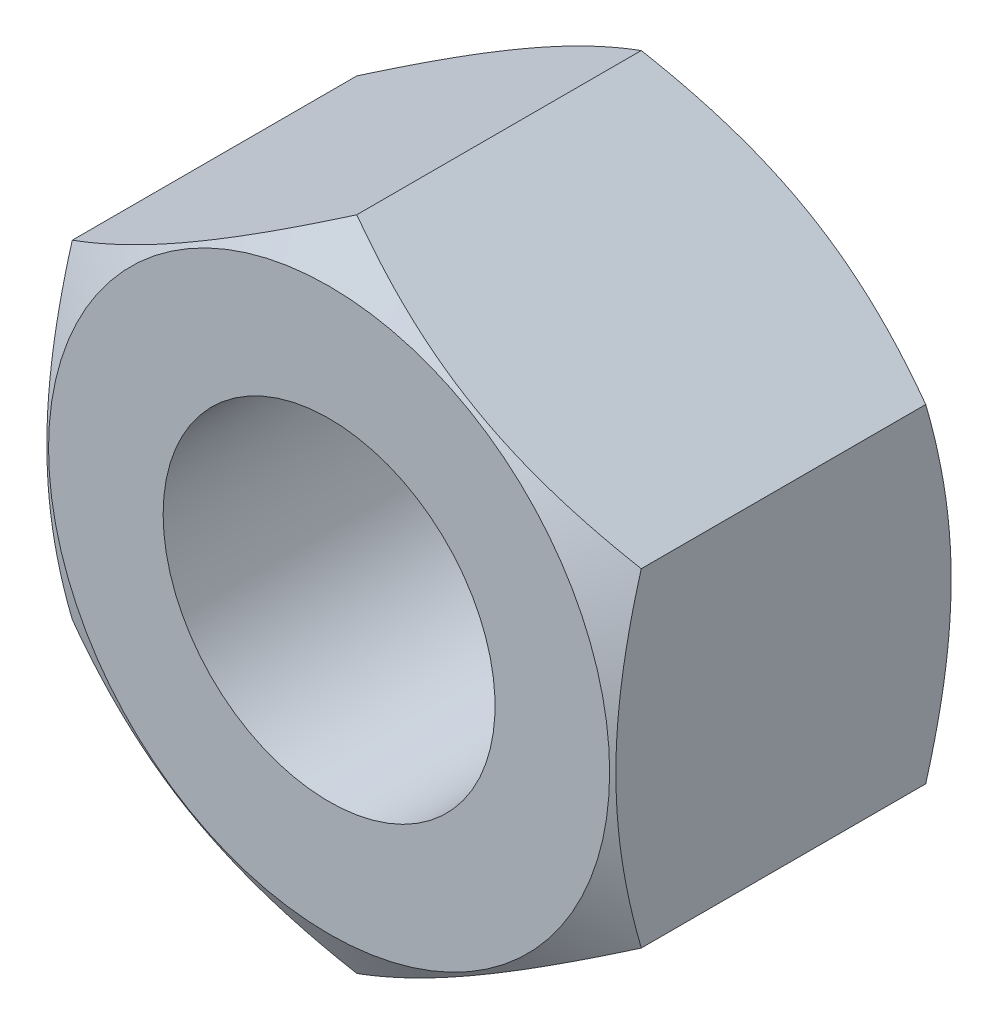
ISO-10303-21;
HEADER;
FILE_DESCRIPTION(('STEP AP214'),'2;1');
FILE_NAME('part.step','',(''),(''),'','','');
FILE_SCHEMA(('AUTOMOTIVE_DESIGN { 1 0 10303 214 1 1 1 1 }'));
ENDSEC;
DATA;
#1=APPLICATION_CONTEXT('core data for automotive mechanical design processes');
#2=APPLICATION_PROTOCOL_DEFINITION('international standard','automotive_design',2000,#1);
#3=PRODUCT_CONTEXT('',#1,'mechanical');
#4=PRODUCT('Part','Part','',(#3));
#5=PRODUCT_RELATED_PRODUCT_CATEGORY('part','',(#4));
#6=PRODUCT_DEFINITION_FORMATION('','',#4);
#7=PRODUCT_DEFINITION_CONTEXT('part definition',#1,'design');
#8=PRODUCT_DEFINITION('design','',#6,#7);
#9=PRODUCT_DEFINITION_SHAPE('','',#8);
#10=(LENGTH_UNIT() NAMED_UNIT(*) SI_UNIT(.MILLI.,.METRE.));
#11=(NAMED_UNIT(*) PLANE_ANGLE_UNIT() SI_UNIT($,.RADIAN.));
#12=(NAMED_UNIT(*) SI_UNIT($,.STERADIAN.) SOLID_ANGLE_UNIT());
#13=UNCERTAINTY_MEASURE_WITH_UNIT(LENGTH_MEASURE(1.E-05),#10,'distance_accuracy_value','');
#14=(GEOMETRIC_REPRESENTATION_CONTEXT(3) GLOBAL_UNCERTAINTY_ASSIGNED_CONTEXT((#13)) GLOBAL_UNIT_ASSIGNED_CONTEXT((#10,
#11,#12)) REPRESENTATION_CONTEXT('',''));
#15=CARTESIAN_POINT('',(0.,0.,0.));
#16=DIRECTION('',(0.,0.,1.));
#17=DIRECTION('',(1.,0.,0.));
#18=AXIS2_PLACEMENT_3D('',#15,#16,#17);
#19=CARTESIAN_POINT('',(18.,-10.3923048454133,21.5));
#20=DIRECTION('',(-1.,0.,0.));
#21=DIRECTION('',(0.,-1.,0.));
#22=AXIS2_PLACEMENT_3D('',#19,#20,#21);
#23=PLANE('',#22);
#24=DIRECTION('',(0.,0.,-1.));
#25=VECTOR('',#24,1.);
#26=CARTESIAN_POINT('',(18.,10.3923048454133,21.5));
#27=LINE('',#26,#25);
#28=CARTESIAN_POINT('',(18.,10.3923048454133,19.7479672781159));
#29=VERTEX_POINT('',#28);
#30=CARTESIAN_POINT('',(18.,10.3923048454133,1.75203272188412));
#31=VERTEX_POINT('',#30);
#32=EDGE_CURVE('E11',#29,#31,#27,.T.);
#33=ORIENTED_EDGE('',*,*,#32,.F.);
#34=CARTESIAN_POINT('',(18.,-27.5419091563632,12.7518557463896));
#35=CARTESIAN_POINT('',(18.,-27.1468507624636,12.9427796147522));
#36=CARTESIAN_POINT('',(18.,-26.7513142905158,13.1327137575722));
#37=CARTESIAN_POINT('',(18.,-25.9591841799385,13.5103753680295));
#38=CARTESIAN_POINT('',(18.,-25.5625905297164,13.6981028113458));
#39=CARTESIAN_POINT('',(18.,-24.3709558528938,14.2576887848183));
#40=CARTESIAN_POINT('',(18.,-23.5741898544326,14.6258885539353));
#41=CARTESIAN_POINT('',(18.,-21.9705755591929,15.3522614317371));
#42=CARTESIAN_POINT('',(18.,-21.1636956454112,15.710364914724));
#43=CARTESIAN_POINT('',(18.,-19.5432973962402,16.4111677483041));
#44=CARTESIAN_POINT('',(18.,-18.7297794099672,16.7538679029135));
#45=CARTESIAN_POINT('',(18.,-17.0848055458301,17.4237877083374));
#46=CARTESIAN_POINT('',(18.,-16.2532518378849,17.7507683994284));
#47=CARTESIAN_POINT('',(18.,-14.5803233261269,18.3790718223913));
#48=CARTESIAN_POINT('',(18.,-13.7389474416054,18.6803917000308));
#49=CARTESIAN_POINT('',(18.,-12.0467985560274,19.249258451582));
#50=CARTESIAN_POINT('',(18.,-11.1960499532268,19.5168773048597));
#51=CARTESIAN_POINT('',(18.,-9.48237686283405,20.0096508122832));
#52=CARTESIAN_POINT('',(18.,-8.61945632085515,20.234818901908));
#53=CARTESIAN_POINT('',(18.,-7.31578110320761,20.5324814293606));
#54=CARTESIAN_POINT('',(18.,-6.87957664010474,20.6250366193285));
#55=CARTESIAN_POINT('',(18.,-6.00426857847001,20.7953196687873));
#56=CARTESIAN_POINT('',(18.,-5.56516504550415,20.8730478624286));
#57=CARTESIAN_POINT('',(18.,-4.68435502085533,21.0122977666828));
#58=CARTESIAN_POINT('',(18.,-4.24264837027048,21.0738184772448));
#59=CARTESIAN_POINT('',(18.,-3.35713985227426,21.179417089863));
#60=CARTESIAN_POINT('',(18.,-2.91333798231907,21.2234949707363));
#61=CARTESIAN_POINT('',(18.,-2.02709190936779,21.2930223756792));
#62=CARTESIAN_POINT('',(18.,-1.58465687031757,21.3185879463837));
#63=CARTESIAN_POINT('',(18.,-0.699103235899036,21.3509566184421));
#64=CARTESIAN_POINT('',(18.,-0.255984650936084,21.3577600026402));
#65=CARTESIAN_POINT('',(18.,0.630018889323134,21.3524430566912));
#66=CARTESIAN_POINT('',(18.,1.07290387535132,21.3403279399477));
#67=CARTESIAN_POINT('',(18.,1.95777383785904,21.29747464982));
#68=CARTESIAN_POINT('',(18.,2.39975877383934,21.2667356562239));
#69=CARTESIAN_POINT('',(18.,3.47131410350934,21.1702750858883));
#70=CARTESIAN_POINT('',(18.,4.10005931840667,21.0952051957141));
#71=CARTESIAN_POINT('',(18.,5.35261077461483,20.9115617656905));
#72=CARTESIAN_POINT('',(18.,5.97641626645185,20.8029832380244));
#73=CARTESIAN_POINT('',(18.,7.84151804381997,20.4324322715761));
#74=CARTESIAN_POINT('',(18.,9.07406142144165,20.1258918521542));
#75=CARTESIAN_POINT('',(18.,10.9177013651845,19.5974851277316));
#76=CARTESIAN_POINT('',(18.,11.5384347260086,19.407337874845));
#77=CARTESIAN_POINT('',(18.,12.7739044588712,19.0081272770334));
#78=CARTESIAN_POINT('',(18.,13.3886402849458,18.7990622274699));
#79=CARTESIAN_POINT('',(18.,14.609050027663,18.3664674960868));
#80=CARTESIAN_POINT('',(18.,15.2147555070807,18.1430261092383));
#81=CARTESIAN_POINT('',(18.,16.1195013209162,17.7982107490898));
#82=CARTESIAN_POINT('',(18.,16.4203993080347,17.6816831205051));
#83=CARTESIAN_POINT('',(18.,17.021027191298,17.445671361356));
#84=CARTESIAN_POINT('',(18.,17.3207571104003,17.326187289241));
#85=CARTESIAN_POINT('',(18.,17.6199435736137,17.2053584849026));
#86=B_SPLINE_CURVE_WITH_KNOTS('',3,(#34,#35,#36,#37,#38,#39,#40,#41,#42,#43,#44,#45,#46,#47,#48,
#49,#50,#51,#52,#53,#54,#55,#56,#57,#58,#59,#60,#61,#62,#63,#64,#65,#66,#67,#68,#69,#70,#71,#72,
#73,#74,#75,#76,#77,#78,#79,#80,#81,#82,#83,#84,#85),.UNSPECIFIED.,.F.,.F.,(4,2,2,2,2,2,2,2,2,2,
2,2,2,2,2,2,2,2,2,2,2,2,2,2,2,4),(0.,1.31632091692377,2.63265632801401,5.26575636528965,
7.91395956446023,10.5620243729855,13.2422944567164,15.9228622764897,18.5976041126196,
21.2714979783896,22.6090335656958,23.9465390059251,25.2841269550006,26.6217165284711,
27.9508469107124,29.2799572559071,30.6087014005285,31.9375040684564,33.8360577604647,
35.7348941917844,39.5398865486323,41.4873464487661,43.4349820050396,45.3716254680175,
46.3396328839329,47.3076211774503),.UNSPECIFIED.);
#87=CARTESIAN_POINT('',(18.,-10.3923048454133,19.7479672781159));
#88=VERTEX_POINT('',#87);
#89=EDGE_CURVE('E183',#29,#88,#86,.F.);
#90=ORIENTED_EDGE('',*,*,#89,.T.);
#91=DIRECTION('',(0.,0.,-1.));
#92=VECTOR('',#91,1.);
#93=CARTESIAN_POINT('',(18.,-10.3923048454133,21.5));
#94=LINE('',#93,#92);
#95=CARTESIAN_POINT('',(18.,-10.3923048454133,1.75203272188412));
#96=VERTEX_POINT('',#95);
#97=EDGE_CURVE('E58',#88,#96,#94,.T.);
#98=ORIENTED_EDGE('',*,*,#97,.T.);
#99=CARTESIAN_POINT('',(18.,-27.5419091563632,8.74814425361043));
#100=CARTESIAN_POINT('',(18.,-27.1468507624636,8.5572203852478));
#101=CARTESIAN_POINT('',(18.,-26.7513142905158,8.36728624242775));
#102=CARTESIAN_POINT('',(18.,-25.9591841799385,7.98962463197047));
#103=CARTESIAN_POINT('',(18.,-25.5625905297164,7.80189718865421));
#104=CARTESIAN_POINT('',(18.,-24.3709558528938,7.24231121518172));
#105=CARTESIAN_POINT('',(18.,-23.5741898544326,6.87411144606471));
#106=CARTESIAN_POINT('',(18.,-21.9705755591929,6.14773856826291));
#107=CARTESIAN_POINT('',(18.,-21.1636956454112,5.78963508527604));
#108=CARTESIAN_POINT('',(18.,-19.5432973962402,5.08883225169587));
#109=CARTESIAN_POINT('',(18.,-18.7297794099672,4.74613209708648));
#110=CARTESIAN_POINT('',(18.,-17.0848055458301,4.07621229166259));
#111=CARTESIAN_POINT('',(18.,-16.2532518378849,3.74923160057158));
#112=CARTESIAN_POINT('',(18.,-14.5803233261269,3.1209281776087));
#113=CARTESIAN_POINT('',(18.,-13.7389474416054,2.81960829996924));
#114=CARTESIAN_POINT('',(18.,-12.0467985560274,2.25074154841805));
#115=CARTESIAN_POINT('',(18.,-11.1960499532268,1.98312269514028));
#116=CARTESIAN_POINT('',(18.,-9.48237686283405,1.49034918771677));
#117=CARTESIAN_POINT('',(18.,-8.61945632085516,1.26518109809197));
#118=CARTESIAN_POINT('',(18.,-7.31578110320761,0.967518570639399));
#119=CARTESIAN_POINT('',(18.,-6.87957664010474,0.874963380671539));
#120=CARTESIAN_POINT('',(18.,-6.00426857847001,0.704680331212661));
#121=CARTESIAN_POINT('',(18.,-5.56516504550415,0.626952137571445));
#122=CARTESIAN_POINT('',(18.,-4.68435502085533,0.487702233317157));
#123=CARTESIAN_POINT('',(18.,-4.24264837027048,0.426181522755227));
#124=CARTESIAN_POINT('',(18.,-3.35713985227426,0.320582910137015));
#125=CARTESIAN_POINT('',(18.,-2.91333798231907,0.276505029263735));
#126=CARTESIAN_POINT('',(18.,-2.02709190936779,0.206977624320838));
#127=CARTESIAN_POINT('',(18.,-1.58465687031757,0.181412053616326));
#128=CARTESIAN_POINT('',(18.,-0.699103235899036,0.149043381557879));
#129=CARTESIAN_POINT('',(18.,-0.255984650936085,0.142239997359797));
#130=CARTESIAN_POINT('',(18.,0.630018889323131,0.147556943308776));
#131=CARTESIAN_POINT('',(18.,1.07290387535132,0.159672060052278));
#132=CARTESIAN_POINT('',(18.,1.95777383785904,0.202525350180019));
#133=CARTESIAN_POINT('',(18.,2.39975877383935,0.233264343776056));
#134=CARTESIAN_POINT('',(18.,3.47131410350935,0.329724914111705));
#135=CARTESIAN_POINT('',(18.,4.10005931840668,0.404794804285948));
#136=CARTESIAN_POINT('',(18.,5.35261077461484,0.588438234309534));
#137=CARTESIAN_POINT('',(18.,5.97641626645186,0.697016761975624));
#138=CARTESIAN_POINT('',(18.,7.84151804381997,1.06756772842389));
#139=CARTESIAN_POINT('',(18.,9.07406142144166,1.37410814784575));
#140=CARTESIAN_POINT('',(18.,10.9177013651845,1.90251487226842));
#141=CARTESIAN_POINT('',(18.,11.5384347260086,2.09266212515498));
#142=CARTESIAN_POINT('',(18.,12.7739044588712,2.49187272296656));
#143=CARTESIAN_POINT('',(18.,13.3886402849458,2.70093777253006));
#144=CARTESIAN_POINT('',(18.,14.609050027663,3.13353250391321));
#145=CARTESIAN_POINT('',(18.,15.2147555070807,3.3569738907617));
#146=CARTESIAN_POINT('',(18.,16.1195013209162,3.7017892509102));
#147=CARTESIAN_POINT('',(18.,16.4203993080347,3.81831687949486));
#148=CARTESIAN_POINT('',(18.,17.021027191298,4.05432863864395));
#149=CARTESIAN_POINT('',(18.,17.3207571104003,4.17381271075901));
#150=CARTESIAN_POINT('',(18.,17.6199435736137,4.29464151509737));
#151=B_SPLINE_CURVE_WITH_KNOTS('',3,(#99,#100,#101,#102,#103,#104,#105,#106,#107,#108,#109,#110,
#111,#112,#113,#114,#115,#116,#117,#118,#119,#120,#121,#122,#123,#124,#125,#126,#127,#128,#129,
#130,#131,#132,#133,#134,#135,#136,#137,#138,#139,#140,#141,#142,#143,#144,#145,#146,#147,#148,
#149,#150),.UNSPECIFIED.,.F.,.F.,(4,2,2,2,2,2,2,2,2,2,2,2,2,2,2,2,2,2,2,2,2,2,2,2,2,4),(0.,
1.31632091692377,2.63265632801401,5.26575636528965,7.91395956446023,10.5620243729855,
13.2422944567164,15.9228622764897,18.5976041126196,21.2714979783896,22.6090335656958,
23.9465390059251,25.2841269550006,26.6217165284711,27.9508469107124,29.2799572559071,
30.6087014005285,31.9375040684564,33.8360577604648,35.7348941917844,39.5398865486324,
41.4873464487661,43.4349820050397,45.3716254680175,46.3396328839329,47.3076211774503),.UNSPECIFIED.);
#152=EDGE_CURVE('E115',#96,#31,#151,.T.);
#153=ORIENTED_EDGE('',*,*,#152,.T.);
#154=EDGE_LOOP('',(#33,#90,#98,#153));
#155=FACE_BOUND('',#154,.T.);
#156=ADVANCED_FACE('F35',(#155),#23,.F.);
#157=CARTESIAN_POINT('',(18.,10.3923048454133,21.5));
#158=DIRECTION('',(-0.5,-0.866025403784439,0.));
#159=DIRECTION('',(0.866025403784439,-0.5,0.));
#160=AXIS2_PLACEMENT_3D('',#157,#158,#159);
#161=PLANE('',#160);
#162=DIRECTION('',(0.,0.,-1.));
#163=VECTOR('',#162,1.);
#164=CARTESIAN_POINT('',(0.,20.7846096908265,21.5));
#165=LINE('',#164,#163);
#166=CARTESIAN_POINT('',(0.,20.7846096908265,19.7479672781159));
#167=VERTEX_POINT('',#166);
#168=CARTESIAN_POINT('',(0.,20.7846096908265,1.75203272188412));
#169=VERTEX_POINT('',#168);
#170=EDGE_CURVE('E43',#167,#169,#165,.T.);
#171=ORIENTED_EDGE('',*,*,#170,.F.);
#172=CARTESIAN_POINT('',(-0.000199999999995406,20.7847251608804,19.7479006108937));
#173=CARTESIAN_POINT('',(0.395432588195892,20.5563065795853,19.8797690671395));
#174=CARTESIAN_POINT('',(0.792608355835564,20.3269970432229,20.0056535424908));
#175=CARTESIAN_POINT('',(1.59014476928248,19.8665391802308,20.2437911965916));
#176=CARTESIAN_POINT('',(1.99050641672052,19.6353902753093,20.3560398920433));
#177=CARTESIAN_POINT('',(2.79518836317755,19.1708069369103,20.5653971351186));
#178=CARTESIAN_POINT('',(3.19951570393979,18.9373684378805,20.6624698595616));
#179=CARTESIAN_POINT('',(4.01097986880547,18.4688693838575,20.8393906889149));
#180=CARTESIAN_POINT('',(4.41811653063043,18.2338089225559,20.9192397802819));
#181=CARTESIAN_POINT('',(5.22476711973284,17.7680889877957,21.0583171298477));
#182=CARTESIAN_POINT('',(5.62422116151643,17.537464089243,21.118005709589));
#183=CARTESIAN_POINT('',(6.42495960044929,17.0751575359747,21.2180900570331));
#184=CARTESIAN_POINT('',(6.82624403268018,16.8434758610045,21.2584854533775));
#185=CARTESIAN_POINT('',(7.62948698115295,16.3797233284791,21.318963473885));
#186=CARTESIAN_POINT('',(8.03144412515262,16.1476532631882,21.3390702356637));
#187=CARTESIAN_POINT('',(8.83572943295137,15.6832989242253,21.3585385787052));
#188=CARTESIAN_POINT('',(9.23805758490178,15.4510146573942,21.3579008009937));
#189=CARTESIAN_POINT('',(9.99021934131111,15.0167538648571,21.3373288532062));
#190=CARTESIAN_POINT('',(10.3401065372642,14.8147463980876,21.3199032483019));
#191=CARTESIAN_POINT('',(11.0390463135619,14.4112133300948,21.2696933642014));
#192=CARTESIAN_POINT('',(11.3880989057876,14.209687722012,21.2369093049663));
#193=CARTESIAN_POINT('',(12.0852372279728,13.8071947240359,21.1565513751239));
#194=CARTESIAN_POINT('',(12.4333217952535,13.6062280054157,21.1089641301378));
#195=CARTESIAN_POINT('',(13.1278338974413,13.2052512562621,20.9998395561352));
#196=CARTESIAN_POINT('',(13.4742614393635,13.0052412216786,20.93830228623));
#197=CARTESIAN_POINT('',(14.525886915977,12.3980849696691,20.731200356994));
#198=CARTESIAN_POINT('',(15.228039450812,11.99269701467,20.5649849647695));
#199=CARTESIAN_POINT('',(16.6218747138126,11.1879658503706,20.1877442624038));
#200=CARTESIAN_POINT('',(17.3135752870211,10.78861233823,19.9768075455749));
#201=CARTESIAN_POINT('',(18.0002,10.3921893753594,19.7479006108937));
#202=B_SPLINE_CURVE_WITH_KNOTS('',3,(#172,#173,#174,#175,#176,#177,#178,#179,#180,#181,#182,
#183,#184,#185,#186,#187,#188,#189,#190,#191,#192,#193,#194,#195,#196,#197,#198,#199,#200,#201),
.UNSPECIFIED.,.F.,.F.,(4,2,2,2,2,2,2,2,2,2,2,2,2,2,4),(0.,1.42650335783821,2.85347447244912,
4.28376471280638,5.71397301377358,7.10888071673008,8.5038152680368,9.89708828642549,
11.2903182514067,12.5031974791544,13.7160593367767,14.9300201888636,16.1439758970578,
18.6253607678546,21.1018751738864),.UNSPECIFIED.);
#203=EDGE_CURVE('E92',#167,#29,#202,.T.);
#204=ORIENTED_EDGE('',*,*,#203,.T.);
#205=ORIENTED_EDGE('',*,*,#32,.T.);
#206=CARTESIAN_POINT('',(18.0002,10.3921893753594,1.75209938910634));
#207=CARTESIAN_POINT('',(17.6045674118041,10.6206079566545,1.62023093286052));
#208=CARTESIAN_POINT('',(17.2073916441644,10.8499174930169,1.49434645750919));
#209=CARTESIAN_POINT('',(16.4098552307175,11.310375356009,1.25620880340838));
#210=CARTESIAN_POINT('',(16.0094935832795,11.5415242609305,1.14396010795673));
#211=CARTESIAN_POINT('',(15.2048116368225,12.0061075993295,0.934602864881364));
#212=CARTESIAN_POINT('',(14.8004842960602,12.2395460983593,0.837530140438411));
#213=CARTESIAN_POINT('',(13.9890201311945,12.7080451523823,0.660609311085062));
#214=CARTESIAN_POINT('',(13.5818834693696,12.9431056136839,0.580760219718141));
#215=CARTESIAN_POINT('',(12.7752328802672,13.4088255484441,0.44168287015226));
#216=CARTESIAN_POINT('',(12.3757788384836,13.6394504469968,0.381994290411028));
#217=CARTESIAN_POINT('',(11.5750403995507,14.1017570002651,0.28190994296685));
#218=CARTESIAN_POINT('',(11.1737559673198,14.3334386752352,0.241514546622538));
#219=CARTESIAN_POINT('',(10.370513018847,14.7971912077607,0.181036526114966));
#220=CARTESIAN_POINT('',(9.96855587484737,15.0292612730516,0.160929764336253));
#221=CARTESIAN_POINT('',(9.16427056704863,15.4936156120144,0.141461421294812));
#222=CARTESIAN_POINT('',(8.76194241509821,15.7258998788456,0.142099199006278));
#223=CARTESIAN_POINT('',(8.00978065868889,16.1601606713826,0.162671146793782));
#224=CARTESIAN_POINT('',(7.65989346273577,16.3621681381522,0.18009675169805));
#225=CARTESIAN_POINT('',(6.96095368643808,16.765701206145,0.23030663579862));
#226=CARTESIAN_POINT('',(6.61190109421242,16.9672268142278,0.263090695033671));
#227=CARTESIAN_POINT('',(5.91476277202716,17.3697198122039,0.343448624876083));
#228=CARTESIAN_POINT('',(5.56667820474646,17.5706865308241,0.391035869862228));
#229=CARTESIAN_POINT('',(4.87216610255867,17.9716632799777,0.500160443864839));
#230=CARTESIAN_POINT('',(4.52573856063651,18.1716733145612,0.561697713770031));
#231=CARTESIAN_POINT('',(3.47411308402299,18.7788295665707,0.768799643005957));
#232=CARTESIAN_POINT('',(2.77196054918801,19.1842175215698,0.935015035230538));
#233=CARTESIAN_POINT('',(1.37812528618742,19.9889486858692,1.31225573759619));
#234=CARTESIAN_POINT('',(0.686424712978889,20.3883021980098,1.52319245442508));
#235=CARTESIAN_POINT('',(-0.000199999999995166,20.7847251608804,1.75209938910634));
#236=B_SPLINE_CURVE_WITH_KNOTS('',3,(#206,#207,#208,#209,#210,#211,#212,#213,#214,#215,#216,
#217,#218,#219,#220,#221,#222,#223,#224,#225,#226,#227,#228,#229,#230,#231,#232,#233,#234,#235),
.UNSPECIFIED.,.F.,.F.,(4,2,2,2,2,2,2,2,2,2,2,2,2,2,4),(0.,1.42650335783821,2.85347447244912,
4.28376471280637,5.71397301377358,7.10888071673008,8.5038152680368,9.89708828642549,
11.2903182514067,12.5031974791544,13.7160593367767,14.9300201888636,16.1439758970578,
18.6253607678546,21.1018751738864),.UNSPECIFIED.);
#237=EDGE_CURVE('E121',#31,#169,#236,.T.);
#238=ORIENTED_EDGE('',*,*,#237,.T.);
#239=EDGE_LOOP('',(#171,#204,#205,#238));
#240=FACE_BOUND('',#239,.T.);
#241=ADVANCED_FACE('F167',(#240),#161,.F.);
#242=CARTESIAN_POINT('',(0.,20.7846096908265,21.5));
#243=DIRECTION('',(0.5,-0.866025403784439,0.));
#244=DIRECTION('',(0.866025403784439,0.5,0.));
#245=AXIS2_PLACEMENT_3D('',#242,#243,#244);
#246=PLANE('',#245);
#247=DIRECTION('',(0.,0.,-1.));
#248=VECTOR('',#247,1.);
#249=CARTESIAN_POINT('',(-18.,10.3923048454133,21.5));
#250=LINE('',#249,#248);
#251=CARTESIAN_POINT('',(-18.,10.3923048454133,19.7479672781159));
#252=VERTEX_POINT('',#251);
#253=CARTESIAN_POINT('',(-18.,10.3923048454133,1.75203272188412));
#254=VERTEX_POINT('',#253);
#255=EDGE_CURVE('E101',#252,#254,#250,.T.);
#256=ORIENTED_EDGE('',*,*,#255,.F.);
#257=CARTESIAN_POINT('',(-18.0002,10.3921893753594,19.7479006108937));
#258=CARTESIAN_POINT('',(-17.6045674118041,10.6206079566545,19.8797690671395));
#259=CARTESIAN_POINT('',(-17.2073916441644,10.8499174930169,20.0056535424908));
#260=CARTESIAN_POINT('',(-16.4098552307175,11.310375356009,20.2437911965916));
#261=CARTESIAN_POINT('',(-16.0094935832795,11.5415242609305,20.3560398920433));
#262=CARTESIAN_POINT('',(-15.2048116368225,12.0061075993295,20.5653971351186));
#263=CARTESIAN_POINT('',(-14.8004842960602,12.2395460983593,20.6624698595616));
#264=CARTESIAN_POINT('',(-13.9890201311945,12.7080451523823,20.8393906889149));
#265=CARTESIAN_POINT('',(-13.5818834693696,12.9431056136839,20.9192397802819));
#266=CARTESIAN_POINT('',(-12.7752328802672,13.4088255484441,21.0583171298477));
#267=CARTESIAN_POINT('',(-12.3757788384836,13.6394504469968,21.118005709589));
#268=CARTESIAN_POINT('',(-11.5750403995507,14.1017570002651,21.2180900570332));
#269=CARTESIAN_POINT('',(-11.1737559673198,14.3334386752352,21.2584854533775));
#270=CARTESIAN_POINT('',(-10.370513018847,14.7971912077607,21.318963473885));
#271=CARTESIAN_POINT('',(-9.96855587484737,15.0292612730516,21.3390702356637));
#272=CARTESIAN_POINT('',(-9.16427056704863,15.4936156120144,21.3585385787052));
#273=CARTESIAN_POINT('',(-8.76194241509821,15.7258998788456,21.3579008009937));
#274=CARTESIAN_POINT('',(-8.00978065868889,16.1601606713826,21.3373288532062));
#275=CARTESIAN_POINT('',(-7.65989346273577,16.3621681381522,21.319903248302));
#276=CARTESIAN_POINT('',(-6.96095368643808,16.765701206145,21.2696933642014));
#277=CARTESIAN_POINT('',(-6.61190109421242,16.9672268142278,21.2369093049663));
#278=CARTESIAN_POINT('',(-5.91476277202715,17.3697198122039,21.1565513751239));
#279=CARTESIAN_POINT('',(-5.56667820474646,17.5706865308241,21.1089641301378));
#280=CARTESIAN_POINT('',(-4.87216610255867,17.9716632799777,20.9998395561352));
#281=CARTESIAN_POINT('',(-4.5257385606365,18.1716733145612,20.93830228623));
#282=CARTESIAN_POINT('',(-3.47411308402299,18.7788295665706,20.731200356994));
#283=CARTESIAN_POINT('',(-2.77196054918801,19.1842175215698,20.5649849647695));
#284=CARTESIAN_POINT('',(-1.37812528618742,19.9889486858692,20.1877442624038));
#285=CARTESIAN_POINT('',(-0.68642471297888,20.3883021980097,19.9768075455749));
#286=CARTESIAN_POINT('',(0.000200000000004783,20.7847251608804,19.7479006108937));
#287=B_SPLINE_CURVE_WITH_KNOTS('',3,(#257,#258,#259,#260,#261,#262,#263,#264,#265,#266,#267,
#268,#269,#270,#271,#272,#273,#274,#275,#276,#277,#278,#279,#280,#281,#282,#283,#284,#285,#286),
.UNSPECIFIED.,.F.,.F.,(4,2,2,2,2,2,2,2,2,2,2,2,2,2,4),(0.,1.42650335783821,2.85347447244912,
4.28376471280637,5.71397301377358,7.10888071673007,8.5038152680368,9.89708828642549,
11.2903182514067,12.5031974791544,13.7160593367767,14.9300201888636,16.1439758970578,
18.6253607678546,21.1018751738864),.UNSPECIFIED.);
#288=EDGE_CURVE('E87',#252,#167,#287,.T.);
#289=ORIENTED_EDGE('',*,*,#288,.T.);
#290=ORIENTED_EDGE('',*,*,#170,.T.);
#291=CARTESIAN_POINT('',(0.00020000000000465,20.7847251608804,1.75209938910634));
#292=CARTESIAN_POINT('',(-0.395432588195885,20.5563065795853,1.62023093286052));
#293=CARTESIAN_POINT('',(-0.792608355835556,20.3269970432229,1.49434645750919));
#294=CARTESIAN_POINT('',(-1.59014476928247,19.8665391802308,1.25620880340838));
#295=CARTESIAN_POINT('',(-1.99050641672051,19.6353902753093,1.14396010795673));
#296=CARTESIAN_POINT('',(-2.79518836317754,19.1708069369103,0.934602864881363));
#297=CARTESIAN_POINT('',(-3.19951570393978,18.9373684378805,0.837530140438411));
#298=CARTESIAN_POINT('',(-4.01097986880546,18.4688693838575,0.660609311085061));
#299=CARTESIAN_POINT('',(-4.41811653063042,18.2338089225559,0.58076021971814));
#300=CARTESIAN_POINT('',(-5.22476711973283,17.7680889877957,0.441682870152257));
#301=CARTESIAN_POINT('',(-5.62422116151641,17.537464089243,0.381994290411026));
#302=CARTESIAN_POINT('',(-6.42495960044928,17.0751575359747,0.281909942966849));
#303=CARTESIAN_POINT('',(-6.82624403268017,16.8434758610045,0.241514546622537));
#304=CARTESIAN_POINT('',(-7.62948698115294,16.3797233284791,0.181036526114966));
#305=CARTESIAN_POINT('',(-8.03144412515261,16.1476532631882,0.160929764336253));
#306=CARTESIAN_POINT('',(-8.83572943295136,15.6832989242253,0.14146142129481));
#307=CARTESIAN_POINT('',(-9.23805758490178,15.4510146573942,0.142099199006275));
#308=CARTESIAN_POINT('',(-9.9902193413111,15.0167538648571,0.162671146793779));
#309=CARTESIAN_POINT('',(-10.3401065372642,14.8147463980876,0.180096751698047));
#310=CARTESIAN_POINT('',(-11.0390463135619,14.4112133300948,0.230306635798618));
#311=CARTESIAN_POINT('',(-11.3880989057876,14.209687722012,0.263090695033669));
#312=CARTESIAN_POINT('',(-12.0852372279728,13.8071947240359,0.343448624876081));
#313=CARTESIAN_POINT('',(-12.4333217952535,13.6062280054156,0.391035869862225));
#314=CARTESIAN_POINT('',(-13.1278338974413,13.2052512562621,0.500160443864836));
#315=CARTESIAN_POINT('',(-13.4742614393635,13.0052412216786,0.561697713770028));
#316=CARTESIAN_POINT('',(-14.525886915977,12.3980849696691,0.768799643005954));
#317=CARTESIAN_POINT('',(-15.228039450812,11.99269701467,0.935015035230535));
#318=CARTESIAN_POINT('',(-16.6218747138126,11.1879658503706,1.31225573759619));
#319=CARTESIAN_POINT('',(-17.3135752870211,10.78861233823,1.52319245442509));
#320=CARTESIAN_POINT('',(-18.0002,10.3921893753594,1.75209938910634));
#321=B_SPLINE_CURVE_WITH_KNOTS('',3,(#291,#292,#293,#294,#295,#296,#297,#298,#299,#300,#301,
#302,#303,#304,#305,#306,#307,#308,#309,#310,#311,#312,#313,#314,#315,#316,#317,#318,#319,#320),
.UNSPECIFIED.,.F.,.F.,(4,2,2,2,2,2,2,2,2,2,2,2,2,2,4),(0.,1.42650335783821,2.85347447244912,
4.28376471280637,5.71397301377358,7.10888071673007,8.5038152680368,9.89708828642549,
11.2903182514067,12.5031974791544,13.7160593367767,14.9300201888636,16.1439758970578,
18.6253607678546,21.1018751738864),.UNSPECIFIED.);
#322=EDGE_CURVE('E108',#169,#254,#321,.T.);
#323=ORIENTED_EDGE('',*,*,#322,.T.);
#324=EDGE_LOOP('',(#256,#289,#290,#323));
#325=FACE_BOUND('',#324,.T.);
#326=ADVANCED_FACE('F106',(#325),#246,.F.);
#327=CARTESIAN_POINT('',(-18.,10.3923048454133,21.5));
#328=DIRECTION('',(1.,0.,0.));
#329=DIRECTION('',(0.,0.,-1.));
#330=AXIS2_PLACEMENT_3D('',#327,#328,#329);
#331=PLANE('',#330);
#332=DIRECTION('',(0.,0.,-1.));
#333=VECTOR('',#332,1.);
#334=CARTESIAN_POINT('',(-18.,-10.3923048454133,21.5));
#335=LINE('',#334,#333);
#336=CARTESIAN_POINT('',(-18.,-10.3923048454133,19.7479672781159));
#337=VERTEX_POINT('',#336);
#338=CARTESIAN_POINT('',(-18.,-10.3923048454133,1.75203272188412));
#339=VERTEX_POINT('',#338);
#340=EDGE_CURVE('E103',#337,#339,#335,.T.);
#341=ORIENTED_EDGE('',*,*,#340,.F.);
#342=CARTESIAN_POINT('',(-18.,-27.5419091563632,12.7518557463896));
#343=CARTESIAN_POINT('',(-18.,-27.1468507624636,12.9427796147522));
#344=CARTESIAN_POINT('',(-18.,-26.7513142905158,13.1327137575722));
#345=CARTESIAN_POINT('',(-18.,-25.9591841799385,13.5103753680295));
#346=CARTESIAN_POINT('',(-18.,-25.5625905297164,13.6981028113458));
#347=CARTESIAN_POINT('',(-18.,-24.3709558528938,14.2576887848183));
#348=CARTESIAN_POINT('',(-18.,-23.5741898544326,14.6258885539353));
#349=CARTESIAN_POINT('',(-18.,-21.9705755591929,15.3522614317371));
#350=CARTESIAN_POINT('',(-18.,-21.1636956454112,15.710364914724));
#351=CARTESIAN_POINT('',(-18.,-19.5432973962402,16.4111677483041));
#352=CARTESIAN_POINT('',(-18.,-18.7297794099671,16.7538679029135));
#353=CARTESIAN_POINT('',(-18.,-17.0848055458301,17.4237877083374));
#354=CARTESIAN_POINT('',(-18.,-16.2532518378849,17.7507683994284));
#355=CARTESIAN_POINT('',(-18.,-14.5803233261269,18.3790718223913));
#356=CARTESIAN_POINT('',(-18.,-13.7389474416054,18.6803917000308));
#357=CARTESIAN_POINT('',(-18.,-12.0467985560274,19.249258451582));
#358=CARTESIAN_POINT('',(-18.,-11.1960499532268,19.5168773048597));
#359=CARTESIAN_POINT('',(-18.,-9.48237686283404,20.0096508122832));
#360=CARTESIAN_POINT('',(-18.,-8.61945632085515,20.234818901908));
#361=CARTESIAN_POINT('',(-18.,-7.3157811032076,20.5324814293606));
#362=CARTESIAN_POINT('',(-18.,-6.87957664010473,20.6250366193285));
#363=CARTESIAN_POINT('',(-18.,-6.00426857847,20.7953196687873));
#364=CARTESIAN_POINT('',(-18.,-5.56516504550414,20.8730478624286));
#365=CARTESIAN_POINT('',(-18.,-4.68435502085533,21.0122977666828));
#366=CARTESIAN_POINT('',(-18.,-4.24264837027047,21.0738184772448));
#367=CARTESIAN_POINT('',(-18.,-3.35713985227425,21.179417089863));
#368=CARTESIAN_POINT('',(-18.,-2.91333798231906,21.2234949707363));
#369=CARTESIAN_POINT('',(-18.,-2.02709190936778,21.2930223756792));
#370=CARTESIAN_POINT('',(-18.,-1.58465687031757,21.3185879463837));
#371=CARTESIAN_POINT('',(-18.,-0.69910323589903,21.3509566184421));
#372=CARTESIAN_POINT('',(-18.,-0.255984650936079,21.3577600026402));
#373=CARTESIAN_POINT('',(-18.,0.630018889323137,21.3524430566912));
#374=CARTESIAN_POINT('',(-18.,1.07290387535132,21.3403279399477));
#375=CARTESIAN_POINT('',(-18.,1.95777383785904,21.29747464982));
#376=CARTESIAN_POINT('',(-18.,2.39975877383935,21.2667356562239));
#377=CARTESIAN_POINT('',(-18.,3.47131410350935,21.1702750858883));
#378=CARTESIAN_POINT('',(-18.,4.10005931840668,21.0952051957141));
#379=CARTESIAN_POINT('',(-18.,5.35261077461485,20.9115617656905));
#380=CARTESIAN_POINT('',(-18.,5.97641626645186,20.8029832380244));
#381=CARTESIAN_POINT('',(-18.,7.84151804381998,20.4324322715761));
#382=CARTESIAN_POINT('',(-18.,9.07406142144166,20.1258918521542));
#383=CARTESIAN_POINT('',(-18.,10.9177013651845,19.5974851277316));
#384=CARTESIAN_POINT('',(-18.,11.5384347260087,19.407337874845));
#385=CARTESIAN_POINT('',(-18.,12.7739044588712,19.0081272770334));
#386=CARTESIAN_POINT('',(-18.,13.3886402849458,18.7990622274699));
#387=CARTESIAN_POINT('',(-18.,14.609050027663,18.3664674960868));
#388=CARTESIAN_POINT('',(-18.,15.2147555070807,18.1430261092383));
#389=CARTESIAN_POINT('',(-18.,16.1195013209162,17.7982107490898));
#390=CARTESIAN_POINT('',(-18.,16.4203993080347,17.6816831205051));
#391=CARTESIAN_POINT('',(-18.,17.021027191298,17.445671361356));
#392=CARTESIAN_POINT('',(-18.,17.3207571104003,17.326187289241));
#393=CARTESIAN_POINT('',(-18.,17.6199435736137,17.2053584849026));
#394=B_SPLINE_CURVE_WITH_KNOTS('',3,(#342,#343,#344,#345,#346,#347,#348,#349,#350,#351,#352,
#353,#354,#355,#356,#357,#358,#359,#360,#361,#362,#363,#364,#365,#366,#367,#368,#369,#370,#371,
#372,#373,#374,#375,#376,#377,#378,#379,#380,#381,#382,#383,#384,#385,#386,#387,#388,#389,#390,
#391,#392,#393),.UNSPECIFIED.,.F.,.F.,(4,2,2,2,2,2,2,2,2,2,2,2,2,2,2,2,2,2,2,2,2,2,2,2,2,4),(0.,
1.31632091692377,2.63265632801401,5.26575636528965,7.91395956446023,10.5620243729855,
13.2422944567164,15.9228622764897,18.5976041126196,21.2714979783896,22.6090335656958,
23.9465390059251,25.2841269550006,26.6217165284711,27.9508469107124,29.2799572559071,
30.6087014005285,31.9375040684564,33.8360577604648,35.7348941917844,39.5398865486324,
41.4873464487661,43.4349820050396,45.3716254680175,46.3396328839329,47.3076211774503),.UNSPECIFIED.);
#395=EDGE_CURVE('E90',#337,#252,#394,.T.);
#396=ORIENTED_EDGE('',*,*,#395,.T.);
#397=ORIENTED_EDGE('',*,*,#255,.T.);
#398=CARTESIAN_POINT('',(-18.,-27.5419091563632,8.74814425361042));
#399=CARTESIAN_POINT('',(-18.,-27.1468507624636,8.55722038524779));
#400=CARTESIAN_POINT('',(-18.,-26.7513142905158,8.36728624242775));
#401=CARTESIAN_POINT('',(-18.,-25.9591841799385,7.98962463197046));
#402=CARTESIAN_POINT('',(-18.,-25.5625905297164,7.80189718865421));
#403=CARTESIAN_POINT('',(-18.,-24.3709558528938,7.24231121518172));
#404=CARTESIAN_POINT('',(-18.,-23.5741898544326,6.8741114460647));
#405=CARTESIAN_POINT('',(-18.,-21.9705755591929,6.1477385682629));
#406=CARTESIAN_POINT('',(-18.,-21.1636956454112,5.78963508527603));
#407=CARTESIAN_POINT('',(-18.,-19.5432973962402,5.08883225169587));
#408=CARTESIAN_POINT('',(-18.,-18.7297794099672,4.74613209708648));
#409=CARTESIAN_POINT('',(-18.,-17.0848055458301,4.07621229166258));
#410=CARTESIAN_POINT('',(-18.,-16.2532518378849,3.74923160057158));
#411=CARTESIAN_POINT('',(-18.,-14.5803233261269,3.1209281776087));
#412=CARTESIAN_POINT('',(-18.,-13.7389474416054,2.81960829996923));
#413=CARTESIAN_POINT('',(-18.,-12.0467985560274,2.25074154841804));
#414=CARTESIAN_POINT('',(-18.,-11.1960499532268,1.98312269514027));
#415=CARTESIAN_POINT('',(-18.,-9.48237686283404,1.49034918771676));
#416=CARTESIAN_POINT('',(-18.,-8.61945632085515,1.26518109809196));
#417=CARTESIAN_POINT('',(-18.,-7.3157811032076,0.967518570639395));
#418=CARTESIAN_POINT('',(-18.,-6.87957664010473,0.874963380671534));
#419=CARTESIAN_POINT('',(-18.,-6.00426857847,0.704680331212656));
#420=CARTESIAN_POINT('',(-18.,-5.56516504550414,0.626952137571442));
#421=CARTESIAN_POINT('',(-18.,-4.68435502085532,0.487702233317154));
#422=CARTESIAN_POINT('',(-18.,-4.24264837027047,0.426181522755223));
#423=CARTESIAN_POINT('',(-18.,-3.35713985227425,0.32058291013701));
#424=CARTESIAN_POINT('',(-18.,-2.91333798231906,0.276505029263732));
#425=CARTESIAN_POINT('',(-18.,-2.02709190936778,0.206977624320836));
#426=CARTESIAN_POINT('',(-18.,-1.58465687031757,0.181412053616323));
#427=CARTESIAN_POINT('',(-18.,-0.699103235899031,0.149043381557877));
#428=CARTESIAN_POINT('',(-18.,-0.25598465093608,0.142239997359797));
#429=CARTESIAN_POINT('',(-18.,0.630018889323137,0.147556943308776));
#430=CARTESIAN_POINT('',(-18.,1.07290387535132,0.159672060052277));
#431=CARTESIAN_POINT('',(-18.,1.95777383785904,0.202525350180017));
#432=CARTESIAN_POINT('',(-18.,2.39975877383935,0.233264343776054));
#433=CARTESIAN_POINT('',(-18.,3.47131410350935,0.329724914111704));
#434=CARTESIAN_POINT('',(-18.,4.10005931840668,0.404794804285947));
#435=CARTESIAN_POINT('',(-18.,5.35261077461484,0.588438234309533));
#436=CARTESIAN_POINT('',(-18.,5.97641626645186,0.697016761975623));
#437=CARTESIAN_POINT('',(-18.,7.84151804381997,1.06756772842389));
#438=CARTESIAN_POINT('',(-18.,9.07406142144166,1.37410814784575));
#439=CARTESIAN_POINT('',(-18.,10.9177013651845,1.90251487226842));
#440=CARTESIAN_POINT('',(-18.,11.5384347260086,2.09266212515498));
#441=CARTESIAN_POINT('',(-18.,12.7739044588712,2.49187272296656));
#442=CARTESIAN_POINT('',(-18.,13.3886402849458,2.70093777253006));
#443=CARTESIAN_POINT('',(-18.,14.609050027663,3.13353250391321));
#444=CARTESIAN_POINT('',(-18.,15.2147555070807,3.3569738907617));
#445=CARTESIAN_POINT('',(-18.,16.1195013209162,3.7017892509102));
#446=CARTESIAN_POINT('',(-18.,16.4203993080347,3.81831687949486));
#447=CARTESIAN_POINT('',(-18.,17.021027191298,4.05432863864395));
#448=CARTESIAN_POINT('',(-18.,17.3207571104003,4.17381271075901));
#449=CARTESIAN_POINT('',(-18.,17.6199435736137,4.29464151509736));
#450=B_SPLINE_CURVE_WITH_KNOTS('',3,(#398,#399,#400,#401,#402,#403,#404,#405,#406,#407,#408,
#409,#410,#411,#412,#413,#414,#415,#416,#417,#418,#419,#420,#421,#422,#423,#424,#425,#426,#427,
#428,#429,#430,#431,#432,#433,#434,#435,#436,#437,#438,#439,#440,#441,#442,#443,#444,#445,#446,
#447,#448,#449),.UNSPECIFIED.,.F.,.F.,(4,2,2,2,2,2,2,2,2,2,2,2,2,2,2,2,2,2,2,2,2,2,2,2,2,4),(0.,
1.31632091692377,2.63265632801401,5.26575636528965,7.91395956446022,10.5620243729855,
13.2422944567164,15.9228622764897,18.5976041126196,21.2714979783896,22.6090335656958,
23.9465390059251,25.2841269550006,26.6217165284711,27.9508469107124,29.2799572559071,
30.6087014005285,31.9375040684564,33.8360577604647,35.7348941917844,39.5398865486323,
41.4873464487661,43.4349820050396,45.3716254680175,46.3396328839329,47.3076211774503),.UNSPECIFIED.);
#451=EDGE_CURVE('E156',#254,#339,#450,.F.);
#452=ORIENTED_EDGE('',*,*,#451,.T.);
#453=EDGE_LOOP('',(#341,#396,#397,#452));
#454=FACE_BOUND('',#453,.T.);
#455=ADVANCED_FACE('F99',(#454),#331,.F.);
#456=CARTESIAN_POINT('',(-18.,-10.3923048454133,21.5));
#457=DIRECTION('',(0.5,0.866025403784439,0.));
#458=DIRECTION('',(-0.866025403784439,0.5,0.));
#459=AXIS2_PLACEMENT_3D('',#456,#457,#458);
#460=PLANE('',#459);
#461=DIRECTION('',(0.,0.,-1.));
#462=VECTOR('',#461,1.);
#463=CARTESIAN_POINT('',(0.,-20.7846096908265,21.5));
#464=LINE('',#463,#462);
#465=CARTESIAN_POINT('',(0.,-20.7846096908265,19.7479672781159));
#466=VERTEX_POINT('',#465);
#467=CARTESIAN_POINT('',(0.,-20.7846096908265,1.75203272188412));
#468=VERTEX_POINT('',#467);
#469=EDGE_CURVE('E110',#466,#468,#464,.T.);
#470=ORIENTED_EDGE('',*,*,#469,.F.);
#471=CARTESIAN_POINT('',(0.000200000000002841,-20.7847251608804,19.7479006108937));
#472=CARTESIAN_POINT('',(-0.395432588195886,-20.5563065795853,19.8797690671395));
#473=CARTESIAN_POINT('',(-0.792608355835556,-20.3269970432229,20.0056535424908));
#474=CARTESIAN_POINT('',(-1.59014476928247,-19.8665391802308,20.2437911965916));
#475=CARTESIAN_POINT('',(-1.99050641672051,-19.6353902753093,20.3560398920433));
#476=CARTESIAN_POINT('',(-2.79518836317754,-19.1708069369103,20.5653971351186));
#477=CARTESIAN_POINT('',(-3.19951570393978,-18.9373684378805,20.6624698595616));
#478=CARTESIAN_POINT('',(-4.01097986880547,-18.4688693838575,20.8393906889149));
#479=CARTESIAN_POINT('',(-4.41811653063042,-18.2338089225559,20.9192397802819));
#480=CARTESIAN_POINT('',(-5.22476711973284,-17.7680889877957,21.0583171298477));
#481=CARTESIAN_POINT('',(-5.62422116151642,-17.537464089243,21.118005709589));
#482=CARTESIAN_POINT('',(-6.42495960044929,-17.0751575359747,21.2180900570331));
#483=CARTESIAN_POINT('',(-6.82624403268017,-16.8434758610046,21.2584854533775));
#484=CARTESIAN_POINT('',(-7.62948698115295,-16.3797233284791,21.318963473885));
#485=CARTESIAN_POINT('',(-8.03144412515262,-16.1476532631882,21.3390702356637));
#486=CARTESIAN_POINT('',(-8.83572943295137,-15.6832989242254,21.3585385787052));
#487=CARTESIAN_POINT('',(-9.23805758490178,-15.4510146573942,21.3579008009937));
#488=CARTESIAN_POINT('',(-9.99021934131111,-15.0167538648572,21.3373288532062));
#489=CARTESIAN_POINT('',(-10.3401065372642,-14.8147463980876,21.3199032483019));
#490=CARTESIAN_POINT('',(-11.0390463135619,-14.4112133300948,21.2696933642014));
#491=CARTESIAN_POINT('',(-11.3880989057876,-14.209687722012,21.2369093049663));
#492=CARTESIAN_POINT('',(-12.0852372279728,-13.8071947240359,21.1565513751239));
#493=CARTESIAN_POINT('',(-12.4333217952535,-13.6062280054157,21.1089641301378));
#494=CARTESIAN_POINT('',(-13.1278338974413,-13.2052512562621,20.9998395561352));
#495=CARTESIAN_POINT('',(-13.4742614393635,-13.0052412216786,20.93830228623));
#496=CARTESIAN_POINT('',(-14.525886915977,-12.3980849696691,20.731200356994));
#497=CARTESIAN_POINT('',(-15.228039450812,-11.99269701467,20.5649849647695));
#498=CARTESIAN_POINT('',(-16.6218747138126,-11.1879658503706,20.1877442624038));
#499=CARTESIAN_POINT('',(-17.3135752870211,-10.78861233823,19.9768075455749));
#500=CARTESIAN_POINT('',(-18.0002,-10.3921893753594,19.7479006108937));
#501=B_SPLINE_CURVE_WITH_KNOTS('',3,(#471,#472,#473,#474,#475,#476,#477,#478,#479,#480,#481,
#482,#483,#484,#485,#486,#487,#488,#489,#490,#491,#492,#493,#494,#495,#496,#497,#498,#499,#500),
.UNSPECIFIED.,.F.,.F.,(4,2,2,2,2,2,2,2,2,2,2,2,2,2,4),(0.,1.42650335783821,2.85347447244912,
4.28376471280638,5.71397301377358,7.10888071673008,8.50381526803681,9.8970882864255,
11.2903182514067,12.5031974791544,13.7160593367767,14.9300201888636,16.1439758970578,
18.6253607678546,21.1018751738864),.UNSPECIFIED.);
#502=EDGE_CURVE('E50',#466,#337,#501,.T.);
#503=ORIENTED_EDGE('',*,*,#502,.T.);
#504=ORIENTED_EDGE('',*,*,#340,.T.);
#505=CARTESIAN_POINT('',(-18.0002,-10.3921893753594,1.75209938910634));
#506=CARTESIAN_POINT('',(-17.6045674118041,-10.6206079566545,1.62023093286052));
#507=CARTESIAN_POINT('',(-17.2073916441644,-10.8499174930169,1.49434645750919));
#508=CARTESIAN_POINT('',(-16.4098552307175,-11.310375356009,1.25620880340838));
#509=CARTESIAN_POINT('',(-16.0094935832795,-11.5415242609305,1.14396010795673));
#510=CARTESIAN_POINT('',(-15.2048116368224,-12.0061075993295,0.934602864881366));
#511=CARTESIAN_POINT('',(-14.8004842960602,-12.2395460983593,0.837530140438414));
#512=CARTESIAN_POINT('',(-13.9890201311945,-12.7080451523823,0.660609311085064));
#513=CARTESIAN_POINT('',(-13.5818834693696,-12.9431056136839,0.580760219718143));
#514=CARTESIAN_POINT('',(-12.7752328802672,-13.4088255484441,0.441682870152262));
#515=CARTESIAN_POINT('',(-12.3757788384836,-13.6394504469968,0.381994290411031));
#516=CARTESIAN_POINT('',(-11.5750403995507,-14.1017570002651,0.281909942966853));
#517=CARTESIAN_POINT('',(-11.1737559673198,-14.3334386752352,0.24151454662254));
#518=CARTESIAN_POINT('',(-10.370513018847,-14.7971912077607,0.181036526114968));
#519=CARTESIAN_POINT('',(-9.96855587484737,-15.0292612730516,0.160929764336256));
#520=CARTESIAN_POINT('',(-9.16427056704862,-15.4936156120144,0.141461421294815));
#521=CARTESIAN_POINT('',(-8.76194241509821,-15.7258998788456,0.142099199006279));
#522=CARTESIAN_POINT('',(-8.00978065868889,-16.1601606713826,0.162671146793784));
#523=CARTESIAN_POINT('',(-7.65989346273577,-16.3621681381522,0.180096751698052));
#524=CARTESIAN_POINT('',(-6.96095368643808,-16.765701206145,0.230306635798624));
#525=CARTESIAN_POINT('',(-6.61190109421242,-16.9672268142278,0.263090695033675));
#526=CARTESIAN_POINT('',(-5.91476277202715,-17.3697198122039,0.343448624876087));
#527=CARTESIAN_POINT('',(-5.56667820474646,-17.5706865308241,0.391035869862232));
#528=CARTESIAN_POINT('',(-4.87216610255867,-17.9716632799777,0.500160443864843));
#529=CARTESIAN_POINT('',(-4.52573856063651,-18.1716733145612,0.561697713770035));
#530=CARTESIAN_POINT('',(-3.47411308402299,-18.7788295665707,0.768799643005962));
#531=CARTESIAN_POINT('',(-2.77196054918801,-19.1842175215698,0.935015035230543));
#532=CARTESIAN_POINT('',(-1.37812528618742,-19.9889486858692,1.31225573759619));
#533=CARTESIAN_POINT('',(-0.686424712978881,-20.3883021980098,1.52319245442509));
#534=CARTESIAN_POINT('',(0.000200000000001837,-20.7847251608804,1.75209938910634));
#535=B_SPLINE_CURVE_WITH_KNOTS('',3,(#505,#506,#507,#508,#509,#510,#511,#512,#513,#514,#515,
#516,#517,#518,#519,#520,#521,#522,#523,#524,#525,#526,#527,#528,#529,#530,#531,#532,#533,#534),
.UNSPECIFIED.,.F.,.F.,(4,2,2,2,2,2,2,2,2,2,2,2,2,2,4),(0.,1.42650335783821,2.85347447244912,
4.28376471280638,5.71397301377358,7.10888071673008,8.5038152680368,9.89708828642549,
11.2903182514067,12.5031974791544,13.7160593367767,14.9300201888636,16.1439758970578,
18.6253607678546,21.1018751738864),.UNSPECIFIED.);
#536=EDGE_CURVE('E149',#339,#468,#535,.T.);
#537=ORIENTED_EDGE('',*,*,#536,.T.);
#538=EDGE_LOOP('',(#470,#503,#504,#537));
#539=FACE_BOUND('',#538,.T.);
#540=ADVANCED_FACE('F228',(#539),#460,.F.);
#541=CARTESIAN_POINT('',(0.,-20.7846096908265,21.5));
#542=DIRECTION('',(-0.5,0.866025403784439,0.));
#543=DIRECTION('',(-0.866025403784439,-0.5,0.));
#544=AXIS2_PLACEMENT_3D('',#541,#542,#543);
#545=PLANE('',#544);
#546=ORIENTED_EDGE('',*,*,#97,.F.);
#547=CARTESIAN_POINT('',(18.0002,-10.3921893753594,19.7479006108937));
#548=CARTESIAN_POINT('',(17.6045674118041,-10.6206079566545,19.8797690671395));
#549=CARTESIAN_POINT('',(17.2073916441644,-10.8499174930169,20.0056535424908));
#550=CARTESIAN_POINT('',(16.4098552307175,-11.310375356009,20.2437911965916));
#551=CARTESIAN_POINT('',(16.0094935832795,-11.5415242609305,20.3560398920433));
#552=CARTESIAN_POINT('',(15.2048116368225,-12.0061075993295,20.5653971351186));
#553=CARTESIAN_POINT('',(14.8004842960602,-12.2395460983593,20.6624698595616));
#554=CARTESIAN_POINT('',(13.9890201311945,-12.7080451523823,20.8393906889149));
#555=CARTESIAN_POINT('',(13.5818834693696,-12.9431056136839,20.9192397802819));
#556=CARTESIAN_POINT('',(12.7752328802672,-13.4088255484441,21.0583171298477));
#557=CARTESIAN_POINT('',(12.3757788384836,-13.6394504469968,21.118005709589));
#558=CARTESIAN_POINT('',(11.5750403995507,-14.1017570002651,21.2180900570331));
#559=CARTESIAN_POINT('',(11.1737559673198,-14.3334386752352,21.2584854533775));
#560=CARTESIAN_POINT('',(10.3705130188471,-14.7971912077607,21.318963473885));
#561=CARTESIAN_POINT('',(9.96855587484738,-15.0292612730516,21.3390702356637));
#562=CARTESIAN_POINT('',(9.16427056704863,-15.4936156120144,21.3585385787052));
#563=CARTESIAN_POINT('',(8.76194241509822,-15.7258998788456,21.3579008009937));
#564=CARTESIAN_POINT('',(8.00978065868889,-16.1601606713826,21.3373288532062));
#565=CARTESIAN_POINT('',(7.65989346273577,-16.3621681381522,21.3199032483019));
#566=CARTESIAN_POINT('',(6.96095368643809,-16.765701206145,21.2696933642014));
#567=CARTESIAN_POINT('',(6.61190109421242,-16.9672268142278,21.2369093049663));
#568=CARTESIAN_POINT('',(5.91476277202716,-17.3697198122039,21.1565513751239));
#569=CARTESIAN_POINT('',(5.56667820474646,-17.5706865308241,21.1089641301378));
#570=CARTESIAN_POINT('',(4.87216610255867,-17.9716632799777,20.9998395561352));
#571=CARTESIAN_POINT('',(4.52573856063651,-18.1716733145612,20.93830228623));
#572=CARTESIAN_POINT('',(3.47411308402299,-18.7788295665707,20.731200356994));
#573=CARTESIAN_POINT('',(2.77196054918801,-19.1842175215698,20.5649849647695));
#574=CARTESIAN_POINT('',(1.37812528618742,-19.9889486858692,20.1877442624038));
#575=CARTESIAN_POINT('',(0.686424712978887,-20.3883021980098,19.9768075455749));
#576=CARTESIAN_POINT('',(-0.000199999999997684,-20.7847251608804,19.7479006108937));
#577=B_SPLINE_CURVE_WITH_KNOTS('',3,(#547,#548,#549,#550,#551,#552,#553,#554,#555,#556,#557,
#558,#559,#560,#561,#562,#563,#564,#565,#566,#567,#568,#569,#570,#571,#572,#573,#574,#575,#576),
.UNSPECIFIED.,.F.,.F.,(4,2,2,2,2,2,2,2,2,2,2,2,2,2,4),(0.,1.42650335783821,2.85347447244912,
4.28376471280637,5.71397301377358,7.10888071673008,8.5038152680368,9.8970882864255,
11.2903182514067,12.5031974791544,13.7160593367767,14.9300201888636,16.1439758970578,
18.6253607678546,21.1018751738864),.UNSPECIFIED.);
#578=EDGE_CURVE('E298',#88,#466,#577,.T.);
#579=ORIENTED_EDGE('',*,*,#578,.T.);
#580=ORIENTED_EDGE('',*,*,#469,.T.);
#581=CARTESIAN_POINT('',(-0.000199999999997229,-20.7847251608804,1.75209938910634));
#582=CARTESIAN_POINT('',(0.395432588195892,-20.5563065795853,1.62023093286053));
#583=CARTESIAN_POINT('',(0.792608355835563,-20.3269970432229,1.49434645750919));
#584=CARTESIAN_POINT('',(1.59014476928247,-19.8665391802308,1.25620880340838));
#585=CARTESIAN_POINT('',(1.99050641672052,-19.6353902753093,1.14396010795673));
#586=CARTESIAN_POINT('',(2.79518836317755,-19.1708069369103,0.934602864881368));
#587=CARTESIAN_POINT('',(3.19951570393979,-18.9373684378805,0.837530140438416));
#588=CARTESIAN_POINT('',(4.01097986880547,-18.4688693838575,0.660609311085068));
#589=CARTESIAN_POINT('',(4.41811653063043,-18.2338089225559,0.580760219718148));
#590=CARTESIAN_POINT('',(5.22476711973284,-17.7680889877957,0.441682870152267));
#591=CARTESIAN_POINT('',(5.62422116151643,-17.537464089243,0.381994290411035));
#592=CARTESIAN_POINT('',(6.42495960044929,-17.0751575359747,0.281909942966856));
#593=CARTESIAN_POINT('',(6.82624403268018,-16.8434758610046,0.241514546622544));
#594=CARTESIAN_POINT('',(7.62948698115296,-16.3797233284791,0.181036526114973));
#595=CARTESIAN_POINT('',(8.03144412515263,-16.1476532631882,0.160929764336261));
#596=CARTESIAN_POINT('',(8.83572943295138,-15.6832989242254,0.14146142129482));
#597=CARTESIAN_POINT('',(9.23805758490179,-15.4510146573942,0.142099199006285));
#598=CARTESIAN_POINT('',(9.99021934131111,-15.0167538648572,0.162671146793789));
#599=CARTESIAN_POINT('',(10.3401065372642,-14.8147463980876,0.180096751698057));
#600=CARTESIAN_POINT('',(11.0390463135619,-14.4112133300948,0.230306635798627));
#601=CARTESIAN_POINT('',(11.3880989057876,-14.209687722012,0.263090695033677));
#602=CARTESIAN_POINT('',(12.0852372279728,-13.8071947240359,0.343448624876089));
#603=CARTESIAN_POINT('',(12.4333217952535,-13.6062280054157,0.391035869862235));
#604=CARTESIAN_POINT('',(13.1278338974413,-13.2052512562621,0.500160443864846));
#605=CARTESIAN_POINT('',(13.4742614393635,-13.0052412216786,0.561697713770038));
#606=CARTESIAN_POINT('',(14.525886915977,-12.3980849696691,0.768799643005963));
#607=CARTESIAN_POINT('',(15.228039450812,-11.99269701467,0.935015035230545));
#608=CARTESIAN_POINT('',(16.6218747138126,-11.1879658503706,1.3122557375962));
#609=CARTESIAN_POINT('',(17.3135752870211,-10.78861233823,1.52319245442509));
#610=CARTESIAN_POINT('',(18.0002,-10.3921893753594,1.75209938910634));
#611=B_SPLINE_CURVE_WITH_KNOTS('',3,(#581,#582,#583,#584,#585,#586,#587,#588,#589,#590,#591,
#592,#593,#594,#595,#596,#597,#598,#599,#600,#601,#602,#603,#604,#605,#606,#607,#608,#609,#610),
.UNSPECIFIED.,.F.,.F.,(4,2,2,2,2,2,2,2,2,2,2,2,2,2,4),(0.,1.42650335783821,2.85347447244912,
4.28376471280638,5.71397301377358,7.10888071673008,8.50381526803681,9.8970882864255,
11.2903182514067,12.5031974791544,13.7160593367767,14.9300201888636,16.1439758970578,
18.6253607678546,21.1018751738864),.UNSPECIFIED.);
#612=EDGE_CURVE('E140',#468,#96,#611,.T.);
#613=ORIENTED_EDGE('',*,*,#612,.T.);
#614=EDGE_LOOP('',(#546,#579,#580,#613));
#615=FACE_BOUND('',#614,.T.);
#616=ADVANCED_FACE('F132',(#615),#545,.F.);
#617=CARTESIAN_POINT('',(0.,0.,1.75203272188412));
#618=DIRECTION('',(0.,0.,1.));
#619=DIRECTION('',(1.,0.,0.));
#620=AXIS2_PLACEMENT_3D('',#617,#618,#619);
#621=CONICAL_SURFACE('',#620,20.7846096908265,1.0471975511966);
#622=CARTESIAN_POINT('',(0.,0.,0.));
#623=DIRECTION('',(0.,0.,-1.));
#624=DIRECTION('',(-1.,0.,0.));
#625=AXIS2_PLACEMENT_3D('',#622,#623,#624);
#626=CIRCLE('',#625,17.75);
#627=CARTESIAN_POINT('',(-17.75,0.,0.));
#628=VERTEX_POINT('',#627);
#629=EDGE_CURVE('E187',#628,#628,#626,.T.);
#630=ORIENTED_EDGE('',*,*,#629,.F.);
#631=EDGE_LOOP('',(#630));
#632=FACE_BOUND('',#631,.T.);
#633=ORIENTED_EDGE('',*,*,#612,.F.);
#634=ORIENTED_EDGE('',*,*,#536,.F.);
#635=ORIENTED_EDGE('',*,*,#451,.F.);
#636=ORIENTED_EDGE('',*,*,#322,.F.);
#637=ORIENTED_EDGE('',*,*,#237,.F.);
#638=ORIENTED_EDGE('',*,*,#152,.F.);
#639=EDGE_LOOP('',(#633,#634,#635,#636,#637,#638));
#640=FACE_BOUND('',#639,.T.);
#641=ADVANCED_FACE('F126',(#632,#640),#621,.T.);
#642=CARTESIAN_POINT('',(18.,-10.3923048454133,0.));
#643=DIRECTION('',(0.,0.,-1.));
#644=DIRECTION('',(-1.,0.,0.));
#645=AXIS2_PLACEMENT_3D('',#642,#643,#644);
#646=PLANE('',#645);
#647=CARTESIAN_POINT('',(0.,0.,0.));
#648=DIRECTION('',(0.,0.,-1.));
#649=DIRECTION('',(-1.,0.,0.));
#650=AXIS2_PLACEMENT_3D('',#647,#648,#649);
#651=CIRCLE('',#650,10.5);
#652=CARTESIAN_POINT('',(-10.5,0.,0.));
#653=VERTEX_POINT('',#652);
#654=EDGE_CURVE('E291',#653,#653,#651,.T.);
#655=ORIENTED_EDGE('',*,*,#654,.F.);
#656=EDGE_LOOP('',(#655));
#657=FACE_BOUND('',#656,.T.);
#658=ORIENTED_EDGE('',*,*,#629,.T.);
#659=EDGE_LOOP('',(#658));
#660=FACE_BOUND('',#659,.T.);
#661=ADVANCED_FACE('F131',(#657,#660),#646,.T.);
#662=CARTESIAN_POINT('',(0.,0.,21.5));
#663=DIRECTION('',(0.,0.,-1.));
#664=DIRECTION('',(-1.,0.,0.));
#665=AXIS2_PLACEMENT_3D('',#662,#663,#664);
#666=CONICAL_SURFACE('',#665,17.75,1.0471975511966);
#667=CARTESIAN_POINT('',(0.,0.,21.5));
#668=DIRECTION('',(0.,0.,-1.));
#669=DIRECTION('',(-1.,0.,0.));
#670=AXIS2_PLACEMENT_3D('',#667,#668,#669);
#671=CIRCLE('',#670,17.75);
#672=CARTESIAN_POINT('',(-17.75,0.,21.5));
#673=VERTEX_POINT('',#672);
#674=EDGE_CURVE('E293',#673,#673,#671,.T.);
#675=ORIENTED_EDGE('',*,*,#674,.T.);
#676=EDGE_LOOP('',(#675));
#677=FACE_BOUND('',#676,.T.);
#678=ORIENTED_EDGE('',*,*,#203,.F.);
#679=ORIENTED_EDGE('',*,*,#288,.F.);
#680=ORIENTED_EDGE('',*,*,#395,.F.);
#681=ORIENTED_EDGE('',*,*,#502,.F.);
#682=ORIENTED_EDGE('',*,*,#578,.F.);
#683=ORIENTED_EDGE('',*,*,#89,.F.);
#684=EDGE_LOOP('',(#678,#679,#680,#681,#682,#683));
#685=FACE_BOUND('',#684,.T.);
#686=ADVANCED_FACE('F89',(#677,#685),#666,.T.);
#687=CARTESIAN_POINT('',(18.,-10.3923048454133,21.5));
#688=DIRECTION('',(0.,0.,-1.));
#689=DIRECTION('',(-1.,0.,0.));
#690=AXIS2_PLACEMENT_3D('',#687,#688,#689);
#691=PLANE('',#690);
#692=CARTESIAN_POINT('',(0.,0.,21.5));
#693=DIRECTION('',(0.,0.,-1.));
#694=DIRECTION('',(-1.,0.,0.));
#695=AXIS2_PLACEMENT_3D('',#692,#693,#694);
#696=CIRCLE('',#695,10.5);
#697=CARTESIAN_POINT('',(-10.5,0.,21.5));
#698=VERTEX_POINT('',#697);
#699=EDGE_CURVE('E288',#698,#698,#696,.T.);
#700=ORIENTED_EDGE('',*,*,#699,.T.);
#701=EDGE_LOOP('',(#700));
#702=FACE_BOUND('',#701,.T.);
#703=ORIENTED_EDGE('',*,*,#674,.F.);
#704=EDGE_LOOP('',(#703));
#705=FACE_BOUND('',#704,.T.);
#706=ADVANCED_FACE('F259',(#702,#705),#691,.F.);
#707=CARTESIAN_POINT('',(0.,0.,0.));
#708=DIRECTION('',(0.,0.,-1.));
#709=DIRECTION('',(-1.,0.,0.));
#710=AXIS2_PLACEMENT_3D('',#707,#708,#709);
#711=CYLINDRICAL_SURFACE('',#710,10.5);
#712=ORIENTED_EDGE('',*,*,#699,.F.);
#713=EDGE_LOOP('',(#712));
#714=FACE_BOUND('',#713,.T.);
#715=ORIENTED_EDGE('',*,*,#654,.T.);
#716=EDGE_LOOP('',(#715));
#717=FACE_BOUND('',#716,.T.);
#718=ADVANCED_FACE('F274',(#714,#717),#711,.F.);
#719=CLOSED_SHELL('',(#156,#241,#326,#455,#540,#616,#641,#661,#686,#706,#718));
#720=MANIFOLD_SOLID_BREP('B2',#719);
#721=ADVANCED_BREP_SHAPE_REPRESENTATION('',(#18,#720),#14);
#722=SHAPE_DEFINITION_REPRESENTATION(#9,#721);
ENDSEC;
END-ISO-10303-21;
